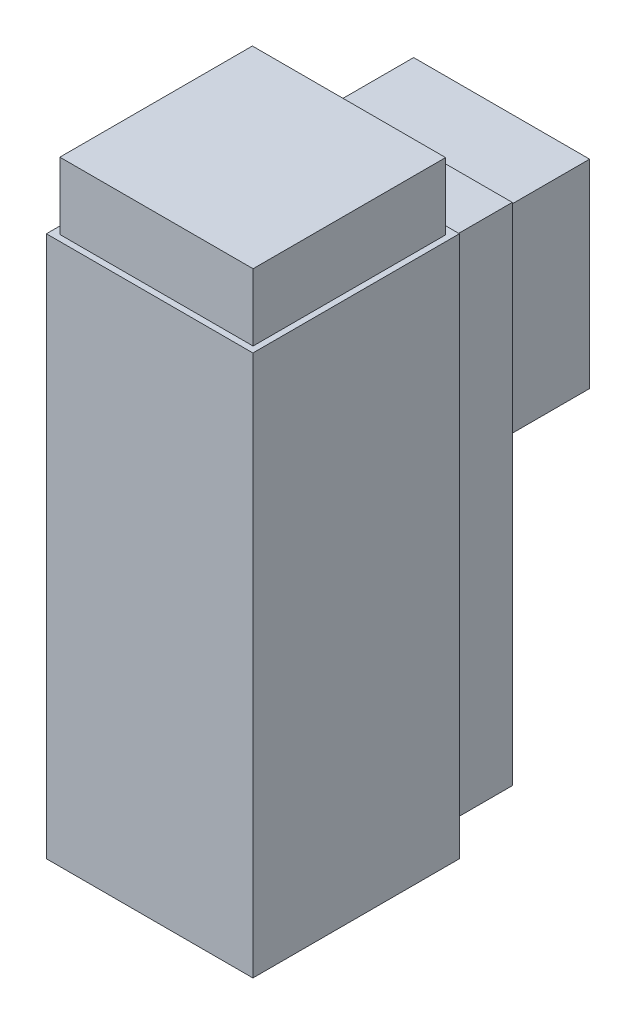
ISO-10303-21;
HEADER;
FILE_DESCRIPTION(('STEP AP214'),'2;1');
FILE_NAME('part.step','',(''),(''),'','','');
FILE_SCHEMA(('AUTOMOTIVE_DESIGN { 1 0 10303 214 1 1 1 1 }'));
ENDSEC;
DATA;
#1=APPLICATION_CONTEXT('core data for automotive mechanical design processes');
#2=APPLICATION_PROTOCOL_DEFINITION('international standard','automotive_design',2000,#1);
#3=PRODUCT_CONTEXT('',#1,'mechanical');
#4=PRODUCT('Part','Part','',(#3));
#5=PRODUCT_RELATED_PRODUCT_CATEGORY('part','',(#4));
#6=PRODUCT_DEFINITION_FORMATION('','',#4);
#7=PRODUCT_DEFINITION_CONTEXT('part definition',#1,'design');
#8=PRODUCT_DEFINITION('design','',#6,#7);
#9=PRODUCT_DEFINITION_SHAPE('','',#8);
#10=(LENGTH_UNIT() NAMED_UNIT(*) SI_UNIT(.MILLI.,.METRE.));
#11=(NAMED_UNIT(*) PLANE_ANGLE_UNIT() SI_UNIT($,.RADIAN.));
#12=(NAMED_UNIT(*) SI_UNIT($,.STERADIAN.) SOLID_ANGLE_UNIT());
#13=UNCERTAINTY_MEASURE_WITH_UNIT(LENGTH_MEASURE(1.E-05),#10,'distance_accuracy_value','');
#14=(GEOMETRIC_REPRESENTATION_CONTEXT(3) GLOBAL_UNCERTAINTY_ASSIGNED_CONTEXT((#13)) GLOBAL_UNIT_ASSIGNED_CONTEXT((#10,
#11,#12)) REPRESENTATION_CONTEXT('',''));
#15=CARTESIAN_POINT('',(0.,0.,0.));
#16=DIRECTION('',(0.,0.,1.));
#17=DIRECTION('',(1.,0.,0.));
#18=AXIS2_PLACEMENT_3D('',#15,#16,#17);
#19=CARTESIAN_POINT('',(-16.5,43.25,33.));
#20=DIRECTION('',(0.,-1.,0.));
#21=DIRECTION('',(0.,0.,-1.));
#22=AXIS2_PLACEMENT_3D('',#19,#20,#21);
#23=PLANE('',#22);
#24=DIRECTION('',(-1.,0.,0.));
#25=VECTOR('',#24,1.);
#26=CARTESIAN_POINT('',(-16.5,43.25,0.));
#27=LINE('',#26,#25);
#28=CARTESIAN_POINT('',(16.5,43.25,0.));
#29=VERTEX_POINT('',#28);
#30=CARTESIAN_POINT('',(-16.5,43.25,0.));
#31=VERTEX_POINT('',#30);
#32=EDGE_CURVE('E257',#29,#31,#27,.T.);
#33=ORIENTED_EDGE('',*,*,#32,.T.);
#34=DIRECTION('',(0.,0.,-1.));
#35=VECTOR('',#34,1.);
#36=CARTESIAN_POINT('',(-16.5,43.25,33.));
#37=LINE('',#36,#35);
#38=CARTESIAN_POINT('',(-16.5,43.25,33.));
#39=VERTEX_POINT('',#38);
#40=EDGE_CURVE('E267',#39,#31,#37,.T.);
#41=ORIENTED_EDGE('',*,*,#40,.F.);
#42=DIRECTION('',(-1.,0.,0.));
#43=VECTOR('',#42,1.);
#44=CARTESIAN_POINT('',(-16.5,43.25,33.));
#45=LINE('',#44,#43);
#46=CARTESIAN_POINT('',(16.5,43.25,33.));
#47=VERTEX_POINT('',#46);
#48=EDGE_CURVE('E247',#47,#39,#45,.T.);
#49=ORIENTED_EDGE('',*,*,#48,.F.);
#50=DIRECTION('',(0.,0.,-1.));
#51=VECTOR('',#50,1.);
#52=CARTESIAN_POINT('',(16.5,43.25,33.));
#53=LINE('',#52,#51);
#54=EDGE_CURVE('E41',#47,#29,#53,.T.);
#55=ORIENTED_EDGE('',*,*,#54,.T.);
#56=EDGE_LOOP('',(#33,#41,#49,#55));
#57=FACE_BOUND('',#56,.T.);
#58=DIRECTION('',(0.,0.,1.));
#59=VECTOR('',#58,1.);
#60=CARTESIAN_POINT('',(-15.3256088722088,43.25,1.2617084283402));
#61=LINE('',#60,#59);
#62=CARTESIAN_POINT('',(-15.3256088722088,43.25,1.2617084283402));
#63=VERTEX_POINT('',#62);
#64=CARTESIAN_POINT('',(-15.3256088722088,43.25,32.0272963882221));
#65=VERTEX_POINT('',#64);
#66=EDGE_CURVE('E166',#63,#65,#61,.T.);
#67=ORIENTED_EDGE('',*,*,#66,.F.);
#68=DIRECTION('',(-1.,0.,0.));
#69=VECTOR('',#68,1.);
#70=CARTESIAN_POINT('',(-15.3256088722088,43.25,1.2617084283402));
#71=LINE('',#70,#69);
#72=CARTESIAN_POINT('',(15.5543493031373,43.25,1.2617084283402));
#73=VERTEX_POINT('',#72);
#74=EDGE_CURVE('E163',#73,#63,#71,.T.);
#75=ORIENTED_EDGE('',*,*,#74,.F.);
#76=DIRECTION('',(0.,0.,-1.));
#77=VECTOR('',#76,1.);
#78=CARTESIAN_POINT('',(15.5543493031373,43.25,1.2617084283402));
#79=LINE('',#78,#77);
#80=CARTESIAN_POINT('',(15.5543493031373,43.25,32.0272963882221));
#81=VERTEX_POINT('',#80);
#82=EDGE_CURVE('E53',#81,#73,#79,.T.);
#83=ORIENTED_EDGE('',*,*,#82,.F.);
#84=DIRECTION('',(1.,0.,0.));
#85=VECTOR('',#84,1.);
#86=CARTESIAN_POINT('',(-15.3256088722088,43.25,32.0272963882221));
#87=LINE('',#86,#85);
#88=EDGE_CURVE('E48',#65,#81,#87,.T.);
#89=ORIENTED_EDGE('',*,*,#88,.F.);
#90=EDGE_LOOP('',(#67,#75,#83,#89));
#91=FACE_BOUND('',#90,.T.);
#92=ADVANCED_FACE('F33',(#57,#91),#23,.F.);
#93=CARTESIAN_POINT('',(0.,0.,-10.));
#94=DIRECTION('',(0.,0.,-1.));
#95=DIRECTION('',(-1.,0.,0.));
#96=AXIS2_PLACEMENT_3D('',#93,#94,#95);
#97=PLANE('',#96);
#98=DIRECTION('',(0.,-1.,0.));
#99=VECTOR('',#98,1.);
#100=CARTESIAN_POINT('',(14.9510584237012,41.8143804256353,-10.));
#101=LINE('',#100,#99);
#102=CARTESIAN_POINT('',(14.9510584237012,41.8143804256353,-10.));
#103=VERTEX_POINT('',#102);
#104=CARTESIAN_POINT('',(14.9510584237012,-38.9107491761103,-10.));
#105=VERTEX_POINT('',#104);
#106=EDGE_CURVE('E202',#103,#105,#101,.T.);
#107=ORIENTED_EDGE('',*,*,#106,.T.);
#108=DIRECTION('',(-1.,0.,0.));
#109=VECTOR('',#108,1.);
#110=CARTESIAN_POINT('',(14.9510584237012,-38.9107491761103,-10.));
#111=LINE('',#110,#109);
#112=CARTESIAN_POINT('',(-15.2730422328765,-38.9107491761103,-10.));
#113=VERTEX_POINT('',#112);
#114=EDGE_CURVE('E205',#105,#113,#111,.T.);
#115=ORIENTED_EDGE('',*,*,#114,.T.);
#116=DIRECTION('',(0.,1.,0.));
#117=VECTOR('',#116,1.);
#118=CARTESIAN_POINT('',(-15.2730422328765,41.8143804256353,-10.));
#119=LINE('',#118,#117);
#120=CARTESIAN_POINT('',(-15.2730422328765,41.8143804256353,-10.));
#121=VERTEX_POINT('',#120);
#122=EDGE_CURVE('E208',#113,#121,#119,.T.);
#123=ORIENTED_EDGE('',*,*,#122,.T.);
#124=DIRECTION('',(1.,0.,0.));
#125=VECTOR('',#124,1.);
#126=CARTESIAN_POINT('',(14.9510584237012,41.8143804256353,-10.));
#127=LINE('',#126,#125);
#128=EDGE_CURVE('E210',#121,#103,#127,.T.);
#129=ORIENTED_EDGE('',*,*,#128,.T.);
#130=EDGE_LOOP('',(#107,#115,#123,#129));
#131=FACE_BOUND('',#130,.T.);
#132=DIRECTION('',(-1.,0.,0.));
#133=VECTOR('',#132,1.);
#134=CARTESIAN_POINT('',(13.8033077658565,8.72090312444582,-10.));
#135=LINE('',#134,#133);
#136=CARTESIAN_POINT('',(13.8033077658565,8.72090312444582,-10.));
#137=VERTEX_POINT('',#136);
#138=CARTESIAN_POINT('',(-14.3165833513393,8.72090312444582,-10.));
#139=VERTEX_POINT('',#138);
#140=EDGE_CURVE('E170',#137,#139,#135,.T.);
#141=ORIENTED_EDGE('',*,*,#140,.F.);
#142=DIRECTION('',(0.,-1.,0.));
#143=VECTOR('',#142,1.);
#144=CARTESIAN_POINT('',(13.8033077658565,40.4753379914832,-10.));
#145=LINE('',#144,#143);
#146=CARTESIAN_POINT('',(13.8033077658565,40.4753379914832,-10.));
#147=VERTEX_POINT('',#146);
#148=EDGE_CURVE('E167',#147,#137,#145,.T.);
#149=ORIENTED_EDGE('',*,*,#148,.F.);
#150=DIRECTION('',(1.,0.,0.));
#151=VECTOR('',#150,1.);
#152=CARTESIAN_POINT('',(13.8033077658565,40.4753379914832,-10.));
#153=LINE('',#152,#151);
#154=CARTESIAN_POINT('',(-14.3165833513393,40.4753379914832,-10.));
#155=VERTEX_POINT('',#154);
#156=EDGE_CURVE('E180',#155,#147,#153,.T.);
#157=ORIENTED_EDGE('',*,*,#156,.F.);
#158=DIRECTION('',(0.,1.,0.));
#159=VECTOR('',#158,1.);
#160=CARTESIAN_POINT('',(-14.3165833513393,40.4753379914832,-10.));
#161=LINE('',#160,#159);
#162=EDGE_CURVE('E188',#139,#155,#161,.T.);
#163=ORIENTED_EDGE('',*,*,#162,.F.);
#164=EDGE_LOOP('',(#141,#149,#157,#163));
#165=FACE_BOUND('',#164,.T.);
#166=ADVANCED_FACE('F305',(#131,#165),#97,.T.);
#167=CARTESIAN_POINT('',(0.,0.,0.));
#168=DIRECTION('',(0.,0.,1.));
#169=DIRECTION('',(1.,0.,0.));
#170=AXIS2_PLACEMENT_3D('',#167,#168,#169);
#171=PLANE('',#170);
#172=DIRECTION('',(0.,1.,0.));
#173=VECTOR('',#172,1.);
#174=CARTESIAN_POINT('',(16.5,43.25,0.));
#175=LINE('',#174,#173);
#176=CARTESIAN_POINT('',(16.5,-43.25,0.));
#177=VERTEX_POINT('',#176);
#178=EDGE_CURVE('E243',#177,#29,#175,.T.);
#179=ORIENTED_EDGE('',*,*,#178,.F.);
#180=DIRECTION('',(1.,0.,0.));
#181=VECTOR('',#180,1.);
#182=CARTESIAN_POINT('',(-16.5,-43.25,0.));
#183=LINE('',#182,#181);
#184=CARTESIAN_POINT('',(-16.5,-43.25,0.));
#185=VERTEX_POINT('',#184);
#186=EDGE_CURVE('E248',#185,#177,#183,.T.);
#187=ORIENTED_EDGE('',*,*,#186,.F.);
#188=DIRECTION('',(0.,-1.,0.));
#189=VECTOR('',#188,1.);
#190=CARTESIAN_POINT('',(-16.5,43.25,0.));
#191=LINE('',#190,#189);
#192=EDGE_CURVE('E259',#31,#185,#191,.T.);
#193=ORIENTED_EDGE('',*,*,#192,.F.);
#194=ORIENTED_EDGE('',*,*,#32,.F.);
#195=EDGE_LOOP('',(#179,#187,#193,#194));
#196=FACE_BOUND('',#195,.T.);
#197=DIRECTION('',(0.,-1.,0.));
#198=VECTOR('',#197,1.);
#199=CARTESIAN_POINT('',(14.9510584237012,41.8143804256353,0.));
#200=LINE('',#199,#198);
#201=CARTESIAN_POINT('',(14.9510584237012,41.8143804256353,0.));
#202=VERTEX_POINT('',#201);
#203=CARTESIAN_POINT('',(14.9510584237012,-38.9107491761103,0.));
#204=VERTEX_POINT('',#203);
#205=EDGE_CURVE('E201',#202,#204,#200,.T.);
#206=ORIENTED_EDGE('',*,*,#205,.F.);
#207=DIRECTION('',(1.,0.,0.));
#208=VECTOR('',#207,1.);
#209=CARTESIAN_POINT('',(14.9510584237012,41.8143804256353,0.));
#210=LINE('',#209,#208);
#211=CARTESIAN_POINT('',(-15.2730422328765,41.8143804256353,0.));
#212=VERTEX_POINT('',#211);
#213=EDGE_CURVE('E206',#212,#202,#210,.T.);
#214=ORIENTED_EDGE('',*,*,#213,.F.);
#215=DIRECTION('',(0.,1.,0.));
#216=VECTOR('',#215,1.);
#217=CARTESIAN_POINT('',(-15.2730422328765,41.8143804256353,0.));
#218=LINE('',#217,#216);
#219=CARTESIAN_POINT('',(-15.2730422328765,-38.9107491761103,0.));
#220=VERTEX_POINT('',#219);
#221=EDGE_CURVE('E218',#220,#212,#218,.T.);
#222=ORIENTED_EDGE('',*,*,#221,.F.);
#223=DIRECTION('',(-1.,0.,0.));
#224=VECTOR('',#223,1.);
#225=CARTESIAN_POINT('',(14.9510584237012,-38.9107491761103,0.));
#226=LINE('',#225,#224);
#227=EDGE_CURVE('E215',#204,#220,#226,.T.);
#228=ORIENTED_EDGE('',*,*,#227,.F.);
#229=EDGE_LOOP('',(#206,#214,#222,#228));
#230=FACE_BOUND('',#229,.T.);
#231=ADVANCED_FACE('F279',(#196,#230),#171,.F.);
#232=CARTESIAN_POINT('',(16.5,43.25,33.));
#233=DIRECTION('',(-1.,0.,0.));
#234=DIRECTION('',(0.,-1.,0.));
#235=AXIS2_PLACEMENT_3D('',#232,#233,#234);
#236=PLANE('',#235);
#237=ORIENTED_EDGE('',*,*,#178,.T.);
#238=ORIENTED_EDGE('',*,*,#54,.F.);
#239=DIRECTION('',(0.,1.,0.));
#240=VECTOR('',#239,1.);
#241=CARTESIAN_POINT('',(16.5,43.25,33.));
#242=LINE('',#241,#240);
#243=CARTESIAN_POINT('',(16.5,-43.25,33.));
#244=VERTEX_POINT('',#243);
#245=EDGE_CURVE('E244',#244,#47,#242,.T.);
#246=ORIENTED_EDGE('',*,*,#245,.F.);
#247=DIRECTION('',(0.,0.,-1.));
#248=VECTOR('',#247,1.);
#249=CARTESIAN_POINT('',(16.5,-43.25,33.));
#250=LINE('',#249,#248);
#251=EDGE_CURVE('E254',#244,#177,#250,.T.);
#252=ORIENTED_EDGE('',*,*,#251,.T.);
#253=EDGE_LOOP('',(#237,#238,#246,#252));
#254=FACE_BOUND('',#253,.T.);
#255=ADVANCED_FACE('F35',(#254),#236,.F.);
#256=CARTESIAN_POINT('',(-16.5,43.25,33.));
#257=DIRECTION('',(1.,0.,0.));
#258=DIRECTION('',(0.,1.,0.));
#259=AXIS2_PLACEMENT_3D('',#256,#257,#258);
#260=PLANE('',#259);
#261=ORIENTED_EDGE('',*,*,#192,.T.);
#262=DIRECTION('',(0.,0.,-1.));
#263=VECTOR('',#262,1.);
#264=CARTESIAN_POINT('',(-16.5,-43.25,33.));
#265=LINE('',#264,#263);
#266=CARTESIAN_POINT('',(-16.5,-43.25,33.));
#267=VERTEX_POINT('',#266);
#268=EDGE_CURVE('E264',#267,#185,#265,.T.);
#269=ORIENTED_EDGE('',*,*,#268,.F.);
#270=DIRECTION('',(0.,-1.,0.));
#271=VECTOR('',#270,1.);
#272=CARTESIAN_POINT('',(-16.5,43.25,33.));
#273=LINE('',#272,#271);
#274=EDGE_CURVE('E250',#39,#267,#273,.T.);
#275=ORIENTED_EDGE('',*,*,#274,.F.);
#276=ORIENTED_EDGE('',*,*,#40,.T.);
#277=EDGE_LOOP('',(#261,#269,#275,#276));
#278=FACE_BOUND('',#277,.T.);
#279=ADVANCED_FACE('F284',(#278),#260,.F.);
#280=CARTESIAN_POINT('',(-16.5,-43.25,33.));
#281=DIRECTION('',(0.,1.,0.));
#282=DIRECTION('',(0.,0.,1.));
#283=AXIS2_PLACEMENT_3D('',#280,#281,#282);
#284=PLANE('',#283);
#285=CARTESIAN_POINT('',(0.,-43.25,16.5));
#286=DIRECTION('',(0.,1.,0.));
#287=DIRECTION('',(0.,0.,1.));
#288=AXIS2_PLACEMENT_3D('',#285,#286,#287);
#289=CIRCLE('',#288,7.5);
#290=CARTESIAN_POINT('',(0.,-43.25,24.));
#291=VERTEX_POINT('',#290);
#292=EDGE_CURVE('E11',#291,#291,#289,.F.);
#293=ORIENTED_EDGE('',*,*,#292,.F.);
#294=EDGE_LOOP('',(#293));
#295=FACE_BOUND('',#294,.T.);
#296=ORIENTED_EDGE('',*,*,#186,.T.);
#297=ORIENTED_EDGE('',*,*,#251,.F.);
#298=DIRECTION('',(1.,0.,0.));
#299=VECTOR('',#298,1.);
#300=CARTESIAN_POINT('',(-16.5,-43.25,33.));
#301=LINE('',#300,#299);
#302=EDGE_CURVE('E252',#267,#244,#301,.T.);
#303=ORIENTED_EDGE('',*,*,#302,.F.);
#304=ORIENTED_EDGE('',*,*,#268,.T.);
#305=EDGE_LOOP('',(#296,#297,#303,#304));
#306=FACE_BOUND('',#305,.T.);
#307=ADVANCED_FACE('F288',(#295,#306),#284,.F.);
#308=CARTESIAN_POINT('',(0.,0.,33.));
#309=DIRECTION('',(0.,0.,1.));
#310=DIRECTION('',(1.,0.,0.));
#311=AXIS2_PLACEMENT_3D('',#308,#309,#310);
#312=PLANE('',#311);
#313=ORIENTED_EDGE('',*,*,#245,.T.);
#314=ORIENTED_EDGE('',*,*,#48,.T.);
#315=ORIENTED_EDGE('',*,*,#274,.T.);
#316=ORIENTED_EDGE('',*,*,#302,.T.);
#317=EDGE_LOOP('',(#313,#314,#315,#316));
#318=FACE_BOUND('',#317,.T.);
#319=ADVANCED_FACE('F290',(#318),#312,.T.);
#320=CARTESIAN_POINT('',(0.,-51.25,16.5));
#321=DIRECTION('',(0.,1.,0.));
#322=DIRECTION('',(0.,0.,1.));
#323=AXIS2_PLACEMENT_3D('',#320,#321,#322);
#324=CYLINDRICAL_SURFACE('',#323,7.5);
#325=CARTESIAN_POINT('',(0.,-51.25,16.5));
#326=DIRECTION('',(0.,-1.,0.));
#327=DIRECTION('',(0.,0.,-1.));
#328=AXIS2_PLACEMENT_3D('',#325,#326,#327);
#329=CIRCLE('',#328,7.5);
#330=CARTESIAN_POINT('',(0.,-51.25,9.));
#331=VERTEX_POINT('',#330);
#332=EDGE_CURVE('E238',#331,#331,#329,.T.);
#333=ORIENTED_EDGE('',*,*,#332,.F.);
#334=EDGE_LOOP('',(#333));
#335=FACE_BOUND('',#334,.T.);
#336=ORIENTED_EDGE('',*,*,#292,.T.);
#337=EDGE_LOOP('',(#336));
#338=FACE_BOUND('',#337,.T.);
#339=ADVANCED_FACE('F292',(#335,#338),#324,.T.);
#340=CARTESIAN_POINT('',(0.,-51.25,16.5));
#341=DIRECTION('',(0.,-1.,0.));
#342=DIRECTION('',(0.,0.,-1.));
#343=AXIS2_PLACEMENT_3D('',#340,#341,#342);
#344=PLANE('',#343);
#345=CARTESIAN_POINT('',(0.,-51.25,16.6002004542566));
#346=DIRECTION('',(0.,-1.,0.));
#347=DIRECTION('',(0.,0.,-1.));
#348=AXIS2_PLACEMENT_3D('',#345,#346,#347);
#349=CIRCLE('',#348,2.5);
#350=CARTESIAN_POINT('',(0.,-51.25,14.1002004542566));
#351=VERTEX_POINT('',#350);
#352=EDGE_CURVE('E234',#351,#351,#349,.T.);
#353=ORIENTED_EDGE('',*,*,#352,.F.);
#354=EDGE_LOOP('',(#353));
#355=FACE_BOUND('',#354,.T.);
#356=ORIENTED_EDGE('',*,*,#332,.T.);
#357=EDGE_LOOP('',(#356));
#358=FACE_BOUND('',#357,.T.);
#359=ADVANCED_FACE('F298',(#355,#358),#344,.T.);
#360=CARTESIAN_POINT('',(0.,-43.25,16.6002004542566));
#361=DIRECTION('',(0.,-1.,0.));
#362=DIRECTION('',(0.,0.,-1.));
#363=AXIS2_PLACEMENT_3D('',#360,#361,#362);
#364=CYLINDRICAL_SURFACE('',#363,2.5);
#365=CARTESIAN_POINT('',(0.,-43.25,16.6002004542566));
#366=DIRECTION('',(0.,-1.,0.));
#367=DIRECTION('',(0.,0.,-1.));
#368=AXIS2_PLACEMENT_3D('',#365,#366,#367);
#369=CIRCLE('',#368,2.5);
#370=CARTESIAN_POINT('',(0.,-43.25,14.1002004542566));
#371=VERTEX_POINT('',#370);
#372=EDGE_CURVE('E235',#371,#371,#369,.T.);
#373=ORIENTED_EDGE('',*,*,#372,.F.);
#374=EDGE_LOOP('',(#373));
#375=FACE_BOUND('',#374,.T.);
#376=ORIENTED_EDGE('',*,*,#352,.T.);
#377=EDGE_LOOP('',(#376));
#378=FACE_BOUND('',#377,.T.);
#379=ADVANCED_FACE('F344',(#375,#378),#364,.F.);
#380=CARTESIAN_POINT('',(0.,-43.25,16.6002004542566));
#381=DIRECTION('',(0.,-1.,0.));
#382=DIRECTION('',(0.,0.,-1.));
#383=AXIS2_PLACEMENT_3D('',#380,#381,#382);
#384=PLANE('',#383);
#385=ORIENTED_EDGE('',*,*,#372,.T.);
#386=EDGE_LOOP('',(#385));
#387=FACE_BOUND('',#386,.T.);
#388=ADVANCED_FACE('F354',(#387),#384,.T.);
#389=CARTESIAN_POINT('',(14.9510584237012,41.8143804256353,-10.));
#390=DIRECTION('',(-1.,0.,0.));
#391=DIRECTION('',(0.,0.,1.));
#392=AXIS2_PLACEMENT_3D('',#389,#390,#391);
#393=PLANE('',#392);
#394=ORIENTED_EDGE('',*,*,#205,.T.);
#395=DIRECTION('',(0.,0.,1.));
#396=VECTOR('',#395,1.);
#397=CARTESIAN_POINT('',(14.9510584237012,-38.9107491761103,-10.));
#398=LINE('',#397,#396);
#399=EDGE_CURVE('E231',#105,#204,#398,.T.);
#400=ORIENTED_EDGE('',*,*,#399,.F.);
#401=ORIENTED_EDGE('',*,*,#106,.F.);
#402=DIRECTION('',(0.,0.,1.));
#403=VECTOR('',#402,1.);
#404=CARTESIAN_POINT('',(14.9510584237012,41.8143804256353,-10.));
#405=LINE('',#404,#403);
#406=EDGE_CURVE('E212',#103,#202,#405,.T.);
#407=ORIENTED_EDGE('',*,*,#406,.T.);
#408=EDGE_LOOP('',(#394,#400,#401,#407));
#409=FACE_BOUND('',#408,.T.);
#410=ADVANCED_FACE('F363',(#409),#393,.F.);
#411=CARTESIAN_POINT('',(14.9510584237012,-38.9107491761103,-10.));
#412=DIRECTION('',(0.,1.,0.));
#413=DIRECTION('',(0.,0.,1.));
#414=AXIS2_PLACEMENT_3D('',#411,#412,#413);
#415=PLANE('',#414);
#416=ORIENTED_EDGE('',*,*,#227,.T.);
#417=DIRECTION('',(0.,0.,1.));
#418=VECTOR('',#417,1.);
#419=CARTESIAN_POINT('',(-15.2730422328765,-38.9107491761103,-10.));
#420=LINE('',#419,#418);
#421=EDGE_CURVE('E228',#113,#220,#420,.T.);
#422=ORIENTED_EDGE('',*,*,#421,.F.);
#423=ORIENTED_EDGE('',*,*,#114,.F.);
#424=ORIENTED_EDGE('',*,*,#399,.T.);
#425=EDGE_LOOP('',(#416,#422,#423,#424));
#426=FACE_BOUND('',#425,.T.);
#427=ADVANCED_FACE('F378',(#426),#415,.F.);
#428=CARTESIAN_POINT('',(-15.2730422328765,41.8143804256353,-10.));
#429=DIRECTION('',(1.,0.,0.));
#430=DIRECTION('',(0.,0.,-1.));
#431=AXIS2_PLACEMENT_3D('',#428,#429,#430);
#432=PLANE('',#431);
#433=ORIENTED_EDGE('',*,*,#221,.T.);
#434=DIRECTION('',(0.,0.,1.));
#435=VECTOR('',#434,1.);
#436=CARTESIAN_POINT('',(-15.2730422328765,41.8143804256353,-10.));
#437=LINE('',#436,#435);
#438=EDGE_CURVE('E225',#121,#212,#437,.T.);
#439=ORIENTED_EDGE('',*,*,#438,.F.);
#440=ORIENTED_EDGE('',*,*,#122,.F.);
#441=ORIENTED_EDGE('',*,*,#421,.T.);
#442=EDGE_LOOP('',(#433,#439,#440,#441));
#443=FACE_BOUND('',#442,.T.);
#444=ADVANCED_FACE('F388',(#443),#432,.F.);
#445=CARTESIAN_POINT('',(14.9510584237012,41.8143804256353,-10.));
#446=DIRECTION('',(0.,-1.,0.));
#447=DIRECTION('',(0.,0.,-1.));
#448=AXIS2_PLACEMENT_3D('',#445,#446,#447);
#449=PLANE('',#448);
#450=ORIENTED_EDGE('',*,*,#213,.T.);
#451=ORIENTED_EDGE('',*,*,#406,.F.);
#452=ORIENTED_EDGE('',*,*,#128,.F.);
#453=ORIENTED_EDGE('',*,*,#438,.T.);
#454=EDGE_LOOP('',(#450,#451,#452,#453));
#455=FACE_BOUND('',#454,.T.);
#456=ADVANCED_FACE('F398',(#455),#449,.F.);
#457=CARTESIAN_POINT('',(13.8033077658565,40.4753379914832,-23.5));
#458=DIRECTION('',(-1.,0.,0.));
#459=DIRECTION('',(0.,0.,1.));
#460=AXIS2_PLACEMENT_3D('',#457,#458,#459);
#461=PLANE('',#460);
#462=ORIENTED_EDGE('',*,*,#148,.T.);
#463=DIRECTION('',(0.,0.,1.));
#464=VECTOR('',#463,1.);
#465=CARTESIAN_POINT('',(13.8033077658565,8.72090312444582,-23.5));
#466=LINE('',#465,#464);
#467=CARTESIAN_POINT('',(13.8033077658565,8.72090312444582,-23.5));
#468=VERTEX_POINT('',#467);
#469=EDGE_CURVE('E199',#468,#137,#466,.T.);
#470=ORIENTED_EDGE('',*,*,#469,.F.);
#471=DIRECTION('',(0.,-1.,0.));
#472=VECTOR('',#471,1.);
#473=CARTESIAN_POINT('',(13.8033077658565,40.4753379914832,-23.5));
#474=LINE('',#473,#472);
#475=CARTESIAN_POINT('',(13.8033077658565,40.4753379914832,-23.5));
#476=VERTEX_POINT('',#475);
#477=EDGE_CURVE('E176',#476,#468,#474,.T.);
#478=ORIENTED_EDGE('',*,*,#477,.F.);
#479=DIRECTION('',(0.,0.,1.));
#480=VECTOR('',#479,1.);
#481=CARTESIAN_POINT('',(13.8033077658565,40.4753379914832,-23.5));
#482=LINE('',#481,#480);
#483=EDGE_CURVE('E185',#476,#147,#482,.T.);
#484=ORIENTED_EDGE('',*,*,#483,.T.);
#485=EDGE_LOOP('',(#462,#470,#478,#484));
#486=FACE_BOUND('',#485,.T.);
#487=ADVANCED_FACE('F408',(#486),#461,.F.);
#488=CARTESIAN_POINT('',(13.8033077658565,8.72090312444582,-23.5));
#489=DIRECTION('',(0.,1.,0.));
#490=DIRECTION('',(0.,0.,1.));
#491=AXIS2_PLACEMENT_3D('',#488,#489,#490);
#492=PLANE('',#491);
#493=ORIENTED_EDGE('',*,*,#140,.T.);
#494=DIRECTION('',(0.,0.,1.));
#495=VECTOR('',#494,1.);
#496=CARTESIAN_POINT('',(-14.3165833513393,8.72090312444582,-23.5));
#497=LINE('',#496,#495);
#498=CARTESIAN_POINT('',(-14.3165833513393,8.72090312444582,-23.5));
#499=VERTEX_POINT('',#498);
#500=EDGE_CURVE('E196',#499,#139,#497,.T.);
#501=ORIENTED_EDGE('',*,*,#500,.F.);
#502=DIRECTION('',(-1.,0.,0.));
#503=VECTOR('',#502,1.);
#504=CARTESIAN_POINT('',(13.8033077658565,8.72090312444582,-23.5));
#505=LINE('',#504,#503);
#506=EDGE_CURVE('E179',#468,#499,#505,.T.);
#507=ORIENTED_EDGE('',*,*,#506,.F.);
#508=ORIENTED_EDGE('',*,*,#469,.T.);
#509=EDGE_LOOP('',(#493,#501,#507,#508));
#510=FACE_BOUND('',#509,.T.);
#511=ADVANCED_FACE('F424',(#510),#492,.F.);
#512=CARTESIAN_POINT('',(-14.3165833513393,40.4753379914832,-23.5));
#513=DIRECTION('',(1.,0.,0.));
#514=DIRECTION('',(0.,0.,-1.));
#515=AXIS2_PLACEMENT_3D('',#512,#513,#514);
#516=PLANE('',#515);
#517=ORIENTED_EDGE('',*,*,#162,.T.);
#518=DIRECTION('',(0.,0.,1.));
#519=VECTOR('',#518,1.);
#520=CARTESIAN_POINT('',(-14.3165833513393,40.4753379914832,-23.5));
#521=LINE('',#520,#519);
#522=CARTESIAN_POINT('',(-14.3165833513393,40.4753379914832,-23.5));
#523=VERTEX_POINT('',#522);
#524=EDGE_CURVE('E194',#523,#155,#521,.T.);
#525=ORIENTED_EDGE('',*,*,#524,.F.);
#526=DIRECTION('',(0.,1.,0.));
#527=VECTOR('',#526,1.);
#528=CARTESIAN_POINT('',(-14.3165833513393,40.4753379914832,-23.5));
#529=LINE('',#528,#527);
#530=EDGE_CURVE('E182',#499,#523,#529,.T.);
#531=ORIENTED_EDGE('',*,*,#530,.F.);
#532=ORIENTED_EDGE('',*,*,#500,.T.);
#533=EDGE_LOOP('',(#517,#525,#531,#532));
#534=FACE_BOUND('',#533,.T.);
#535=ADVANCED_FACE('F434',(#534),#516,.F.);
#536=CARTESIAN_POINT('',(13.8033077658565,40.4753379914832,-23.5));
#537=DIRECTION('',(0.,-1.,0.));
#538=DIRECTION('',(0.,0.,-1.));
#539=AXIS2_PLACEMENT_3D('',#536,#537,#538);
#540=PLANE('',#539);
#541=ORIENTED_EDGE('',*,*,#156,.T.);
#542=ORIENTED_EDGE('',*,*,#483,.F.);
#543=DIRECTION('',(1.,0.,0.));
#544=VECTOR('',#543,1.);
#545=CARTESIAN_POINT('',(13.8033077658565,40.4753379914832,-23.5));
#546=LINE('',#545,#544);
#547=EDGE_CURVE('E184',#523,#476,#546,.T.);
#548=ORIENTED_EDGE('',*,*,#547,.F.);
#549=ORIENTED_EDGE('',*,*,#524,.T.);
#550=EDGE_LOOP('',(#541,#542,#548,#549));
#551=FACE_BOUND('',#550,.T.);
#552=ADVANCED_FACE('F444',(#551),#540,.F.);
#553=CARTESIAN_POINT('',(0.,0.,-23.5));
#554=DIRECTION('',(0.,0.,-1.));
#555=DIRECTION('',(-1.,0.,0.));
#556=AXIS2_PLACEMENT_3D('',#553,#554,#555);
#557=PLANE('',#556);
#558=ORIENTED_EDGE('',*,*,#477,.T.);
#559=ORIENTED_EDGE('',*,*,#506,.T.);
#560=ORIENTED_EDGE('',*,*,#530,.T.);
#561=ORIENTED_EDGE('',*,*,#547,.T.);
#562=EDGE_LOOP('',(#558,#559,#560,#561));
#563=FACE_BOUND('',#562,.T.);
#564=ADVANCED_FACE('F454',(#563),#557,.T.);
#565=CARTESIAN_POINT('',(-15.3256088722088,53.95,1.2617084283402));
#566=DIRECTION('',(1.,0.,0.));
#567=DIRECTION('',(0.,0.,-1.));
#568=AXIS2_PLACEMENT_3D('',#565,#566,#567);
#569=PLANE('',#568);
#570=ORIENTED_EDGE('',*,*,#66,.T.);
#571=DIRECTION('',(0.,-1.,0.));
#572=VECTOR('',#571,1.);
#573=CARTESIAN_POINT('',(-15.3256088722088,53.95,32.0272963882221));
#574=LINE('',#573,#572);
#575=CARTESIAN_POINT('',(-15.3256088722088,53.95,32.0272963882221));
#576=VERTEX_POINT('',#575);
#577=EDGE_CURVE('E147',#576,#65,#574,.T.);
#578=ORIENTED_EDGE('',*,*,#577,.F.);
#579=DIRECTION('',(0.,0.,1.));
#580=VECTOR('',#579,1.);
#581=CARTESIAN_POINT('',(-15.3256088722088,53.95,1.2617084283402));
#582=LINE('',#581,#580);
#583=CARTESIAN_POINT('',(-15.3256088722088,53.95,1.2617084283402));
#584=VERTEX_POINT('',#583);
#585=EDGE_CURVE('E154',#584,#576,#582,.T.);
#586=ORIENTED_EDGE('',*,*,#585,.F.);
#587=DIRECTION('',(0.,-1.,0.));
#588=VECTOR('',#587,1.);
#589=CARTESIAN_POINT('',(-15.3256088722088,53.95,1.2617084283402));
#590=LINE('',#589,#588);
#591=EDGE_CURVE('E518',#584,#63,#590,.T.);
#592=ORIENTED_EDGE('',*,*,#591,.T.);
#593=EDGE_LOOP('',(#570,#578,#586,#592));
#594=FACE_BOUND('',#593,.T.);
#595=ADVANCED_FACE('F165',(#594),#569,.F.);
#596=CARTESIAN_POINT('',(-15.3256088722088,53.95,32.0272963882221));
#597=DIRECTION('',(0.,0.,-1.));
#598=DIRECTION('',(-1.,0.,0.));
#599=AXIS2_PLACEMENT_3D('',#596,#597,#598);
#600=PLANE('',#599);
#601=ORIENTED_EDGE('',*,*,#88,.T.);
#602=DIRECTION('',(0.,-1.,0.));
#603=VECTOR('',#602,1.);
#604=CARTESIAN_POINT('',(15.5543493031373,53.95,32.0272963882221));
#605=LINE('',#604,#603);
#606=CARTESIAN_POINT('',(15.5543493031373,53.95,32.0272963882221));
#607=VERTEX_POINT('',#606);
#608=EDGE_CURVE('E150',#607,#81,#605,.T.);
#609=ORIENTED_EDGE('',*,*,#608,.F.);
#610=DIRECTION('',(1.,0.,0.));
#611=VECTOR('',#610,1.);
#612=CARTESIAN_POINT('',(-15.3256088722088,53.95,32.0272963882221));
#613=LINE('',#612,#611);
#614=EDGE_CURVE('E143',#576,#607,#613,.T.);
#615=ORIENTED_EDGE('',*,*,#614,.F.);
#616=ORIENTED_EDGE('',*,*,#577,.T.);
#617=EDGE_LOOP('',(#601,#609,#615,#616));
#618=FACE_BOUND('',#617,.T.);
#619=ADVANCED_FACE('F145',(#618),#600,.F.);
#620=CARTESIAN_POINT('',(15.5543493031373,53.95,1.2617084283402));
#621=DIRECTION('',(-1.,0.,0.));
#622=DIRECTION('',(0.,0.,1.));
#623=AXIS2_PLACEMENT_3D('',#620,#621,#622);
#624=PLANE('',#623);
#625=ORIENTED_EDGE('',*,*,#82,.T.);
#626=DIRECTION('',(0.,-1.,0.));
#627=VECTOR('',#626,1.);
#628=CARTESIAN_POINT('',(15.5543493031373,53.95,1.2617084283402));
#629=LINE('',#628,#627);
#630=CARTESIAN_POINT('',(15.5543493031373,53.95,1.2617084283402));
#631=VERTEX_POINT('',#630);
#632=EDGE_CURVE('E172',#631,#73,#629,.T.);
#633=ORIENTED_EDGE('',*,*,#632,.F.);
#634=DIRECTION('',(0.,0.,-1.));
#635=VECTOR('',#634,1.);
#636=CARTESIAN_POINT('',(15.5543493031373,53.95,1.2617084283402));
#637=LINE('',#636,#635);
#638=EDGE_CURVE('E153',#607,#631,#637,.T.);
#639=ORIENTED_EDGE('',*,*,#638,.F.);
#640=ORIENTED_EDGE('',*,*,#608,.T.);
#641=EDGE_LOOP('',(#625,#633,#639,#640));
#642=FACE_BOUND('',#641,.T.);
#643=ADVANCED_FACE('F485',(#642),#624,.F.);
#644=CARTESIAN_POINT('',(-15.3256088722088,53.95,1.2617084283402));
#645=DIRECTION('',(0.,0.,1.));
#646=DIRECTION('',(1.,0.,0.));
#647=AXIS2_PLACEMENT_3D('',#644,#645,#646);
#648=PLANE('',#647);
#649=ORIENTED_EDGE('',*,*,#74,.T.);
#650=ORIENTED_EDGE('',*,*,#591,.F.);
#651=DIRECTION('',(-1.,0.,0.));
#652=VECTOR('',#651,1.);
#653=CARTESIAN_POINT('',(-15.3256088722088,53.95,1.2617084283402));
#654=LINE('',#653,#652);
#655=EDGE_CURVE('E159',#631,#584,#654,.T.);
#656=ORIENTED_EDGE('',*,*,#655,.F.);
#657=ORIENTED_EDGE('',*,*,#632,.T.);
#658=EDGE_LOOP('',(#649,#650,#656,#657));
#659=FACE_BOUND('',#658,.T.);
#660=ADVANCED_FACE('F494',(#659),#648,.F.);
#661=CARTESIAN_POINT('',(0.,53.95,0.));
#662=DIRECTION('',(0.,1.,0.));
#663=DIRECTION('',(0.,0.,1.));
#664=AXIS2_PLACEMENT_3D('',#661,#662,#663);
#665=PLANE('',#664);
#666=ORIENTED_EDGE('',*,*,#585,.T.);
#667=ORIENTED_EDGE('',*,*,#614,.T.);
#668=ORIENTED_EDGE('',*,*,#638,.T.);
#669=ORIENTED_EDGE('',*,*,#655,.T.);
#670=EDGE_LOOP('',(#666,#667,#668,#669));
#671=FACE_BOUND('',#670,.T.);
#672=ADVANCED_FACE('F157',(#671),#665,.T.);
#673=CLOSED_SHELL('',(#92,#166,#231,#255,#279,#307,#319,#339,#359,#379,#388,#410,#427,#444,#456,
#487,#511,#535,#552,#564,#595,#619,#643,#660,#672));
#674=MANIFOLD_SOLID_BREP('B2',#673);
#675=ADVANCED_BREP_SHAPE_REPRESENTATION('',(#18,#674),#14);
#676=SHAPE_DEFINITION_REPRESENTATION(#9,#675);
ENDSEC;
END-ISO-10303-21;
